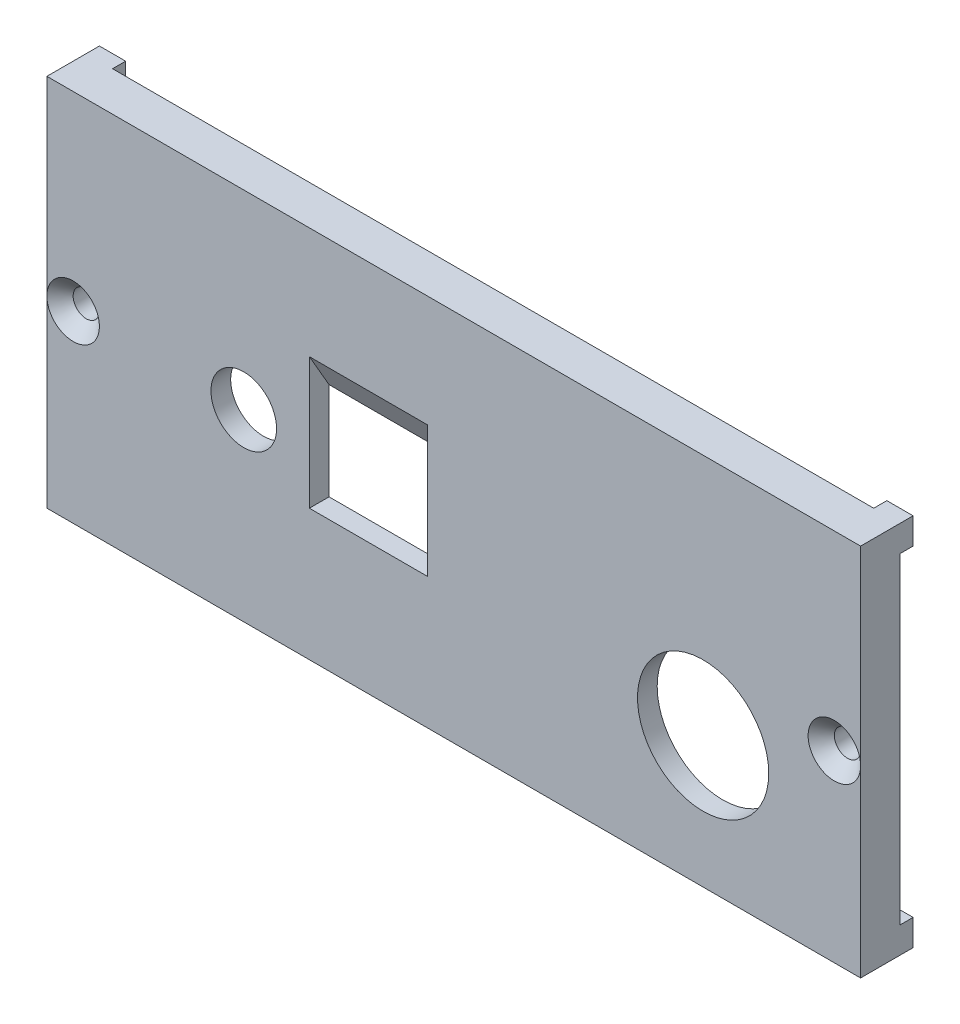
ISO-10303-21;
HEADER;
FILE_DESCRIPTION(('STEP AP214'),'2;1');
FILE_NAME('part.step','',(''),(''),'','','');
FILE_SCHEMA(('AUTOMOTIVE_DESIGN { 1 0 10303 214 1 1 1 1 }'));
ENDSEC;
DATA;
#1=APPLICATION_CONTEXT('core data for automotive mechanical design processes');
#2=APPLICATION_PROTOCOL_DEFINITION('international standard','automotive_design',2000,#1);
#3=PRODUCT_CONTEXT('',#1,'mechanical');
#4=PRODUCT('Part','Part','',(#3));
#5=PRODUCT_RELATED_PRODUCT_CATEGORY('part','',(#4));
#6=PRODUCT_DEFINITION_FORMATION('','',#4);
#7=PRODUCT_DEFINITION_CONTEXT('part definition',#1,'design');
#8=PRODUCT_DEFINITION('design','',#6,#7);
#9=PRODUCT_DEFINITION_SHAPE('','',#8);
#10=(LENGTH_UNIT() NAMED_UNIT(*) SI_UNIT(.MILLI.,.METRE.));
#11=(NAMED_UNIT(*) PLANE_ANGLE_UNIT() SI_UNIT($,.RADIAN.));
#12=(NAMED_UNIT(*) SI_UNIT($,.STERADIAN.) SOLID_ANGLE_UNIT());
#13=UNCERTAINTY_MEASURE_WITH_UNIT(LENGTH_MEASURE(1.E-05),#10,'distance_accuracy_value','');
#14=(GEOMETRIC_REPRESENTATION_CONTEXT(3) GLOBAL_UNCERTAINTY_ASSIGNED_CONTEXT((#13)) GLOBAL_UNIT_ASSIGNED_CONTEXT((#10,
#11,#12)) REPRESENTATION_CONTEXT('',''));
#15=CARTESIAN_POINT('',(0.,0.,0.));
#16=DIRECTION('',(0.,0.,1.));
#17=DIRECTION('',(1.,0.,0.));
#18=AXIS2_PLACEMENT_3D('',#15,#16,#17);
#19=CARTESIAN_POINT('',(31.,28.5,0.));
#20=DIRECTION('',(0.,0.,1.));
#21=DIRECTION('',(1.,0.,0.));
#22=AXIS2_PLACEMENT_3D('',#19,#20,#21);
#23=PLANE('',#22);
#24=CARTESIAN_POINT('',(-29.,14.,0.));
#25=DIRECTION('',(0.,0.,-1.));
#26=DIRECTION('',(-1.,0.,0.));
#27=AXIS2_PLACEMENT_3D('',#24,#25,#26);
#28=CIRCLE('',#27,1.);
#29=CARTESIAN_POINT('',(-30.,14.,0.));
#30=VERTEX_POINT('',#29);
#31=EDGE_CURVE('E231',#30,#30,#28,.T.);
#32=ORIENTED_EDGE('',*,*,#31,.F.);
#33=EDGE_LOOP('',(#32));
#34=FACE_BOUND('',#33,.T.);
#35=CARTESIAN_POINT('',(29.,14.,0.));
#36=DIRECTION('',(0.,0.,-1.));
#37=DIRECTION('',(-1.,0.,0.));
#38=AXIS2_PLACEMENT_3D('',#35,#36,#37);
#39=CIRCLE('',#38,1.);
#40=CARTESIAN_POINT('',(28.,14.,0.));
#41=VERTEX_POINT('',#40);
#42=EDGE_CURVE('E234',#41,#41,#39,.T.);
#43=ORIENTED_EDGE('',*,*,#42,.F.);
#44=EDGE_LOOP('',(#43));
#45=FACE_BOUND('',#44,.T.);
#46=DIRECTION('',(0.,1.,0.));
#47=VECTOR('',#46,1.);
#48=CARTESIAN_POINT('',(-27.,14.25,0.));
#49=LINE('',#48,#47);
#50=CARTESIAN_POINT('',(-27.,2.,0.));
#51=VERTEX_POINT('',#50);
#52=CARTESIAN_POINT('',(-27.,25.5,0.));
#53=VERTEX_POINT('',#52);
#54=EDGE_CURVE('E358',#51,#53,#49,.T.);
#55=ORIENTED_EDGE('',*,*,#54,.F.);
#56=DIRECTION('',(-1.,0.,0.));
#57=VECTOR('',#56,1.);
#58=CARTESIAN_POINT('',(-53.217133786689,2.,0.));
#59=LINE('',#58,#57);
#60=CARTESIAN_POINT('',(27.,2.,0.));
#61=VERTEX_POINT('',#60);
#62=EDGE_CURVE('E355',#61,#51,#59,.T.);
#63=ORIENTED_EDGE('',*,*,#62,.F.);
#64=DIRECTION('',(0.,1.,0.));
#65=VECTOR('',#64,1.);
#66=CARTESIAN_POINT('',(27.,14.25,0.));
#67=LINE('',#66,#65);
#68=CARTESIAN_POINT('',(27.,25.5,0.));
#69=VERTEX_POINT('',#68);
#70=EDGE_CURVE('E808',#61,#69,#67,.T.);
#71=ORIENTED_EDGE('',*,*,#70,.T.);
#72=DIRECTION('',(1.,0.,0.));
#73=VECTOR('',#72,1.);
#74=CARTESIAN_POINT('',(-53.217133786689,25.5,0.));
#75=LINE('',#74,#73);
#76=EDGE_CURVE('E812',#53,#69,#75,.T.);
#77=ORIENTED_EDGE('',*,*,#76,.F.);
#78=EDGE_LOOP('',(#55,#63,#71,#77));
#79=FACE_BOUND('',#78,.T.);
#80=DIRECTION('',(1.,0.,0.));
#81=VECTOR('',#80,1.);
#82=CARTESIAN_POINT('',(-31.,2.,0.));
#83=LINE('',#82,#81);
#84=CARTESIAN_POINT('',(-31.,2.,0.));
#85=VERTEX_POINT('',#84);
#86=CARTESIAN_POINT('',(-29.,2.,0.));
#87=VERTEX_POINT('',#86);
#88=EDGE_CURVE('E237',#85,#87,#83,.T.);
#89=ORIENTED_EDGE('',*,*,#88,.F.);
#90=DIRECTION('',(0.,-1.,0.));
#91=VECTOR('',#90,1.);
#92=CARTESIAN_POINT('',(-31.,0.,0.));
#93=LINE('',#92,#91);
#94=CARTESIAN_POINT('',(-31.,26.5,0.));
#95=VERTEX_POINT('',#94);
#96=EDGE_CURVE('E342',#95,#85,#93,.T.);
#97=ORIENTED_EDGE('',*,*,#96,.F.);
#98=DIRECTION('',(-1.,0.,0.));
#99=VECTOR('',#98,1.);
#100=CARTESIAN_POINT('',(-31.,26.5,0.));
#101=LINE('',#100,#99);
#102=CARTESIAN_POINT('',(-29.,26.5,0.));
#103=VERTEX_POINT('',#102);
#104=EDGE_CURVE('E264',#103,#95,#101,.T.);
#105=ORIENTED_EDGE('',*,*,#104,.F.);
#106=DIRECTION('',(0.,-1.,0.));
#107=VECTOR('',#106,1.);
#108=CARTESIAN_POINT('',(-29.,28.5,0.));
#109=LINE('',#108,#107);
#110=CARTESIAN_POINT('',(-29.,28.5,0.));
#111=VERTEX_POINT('',#110);
#112=EDGE_CURVE('E259',#111,#103,#109,.T.);
#113=ORIENTED_EDGE('',*,*,#112,.F.);
#114=DIRECTION('',(-1.,0.,0.));
#115=VECTOR('',#114,1.);
#116=CARTESIAN_POINT('',(31.,28.5,0.));
#117=LINE('',#116,#115);
#118=CARTESIAN_POINT('',(29.,28.5,0.));
#119=VERTEX_POINT('',#118);
#120=EDGE_CURVE('E332',#119,#111,#117,.T.);
#121=ORIENTED_EDGE('',*,*,#120,.F.);
#122=DIRECTION('',(0.,1.,0.));
#123=VECTOR('',#122,1.);
#124=CARTESIAN_POINT('',(29.,28.5,0.));
#125=LINE('',#124,#123);
#126=CARTESIAN_POINT('',(29.,26.5,0.));
#127=VERTEX_POINT('',#126);
#128=EDGE_CURVE('E307',#127,#119,#125,.T.);
#129=ORIENTED_EDGE('',*,*,#128,.F.);
#130=DIRECTION('',(-1.,0.,0.));
#131=VECTOR('',#130,1.);
#132=CARTESIAN_POINT('',(31.,26.5,0.));
#133=LINE('',#132,#131);
#134=CARTESIAN_POINT('',(31.,26.5,0.));
#135=VERTEX_POINT('',#134);
#136=EDGE_CURVE('E302',#135,#127,#133,.T.);
#137=ORIENTED_EDGE('',*,*,#136,.F.);
#138=DIRECTION('',(0.,1.,0.));
#139=VECTOR('',#138,1.);
#140=CARTESIAN_POINT('',(31.,0.,0.));
#141=LINE('',#140,#139);
#142=CARTESIAN_POINT('',(31.,2.,0.));
#143=VERTEX_POINT('',#142);
#144=EDGE_CURVE('E329',#143,#135,#141,.T.);
#145=ORIENTED_EDGE('',*,*,#144,.F.);
#146=DIRECTION('',(1.,0.,0.));
#147=VECTOR('',#146,1.);
#148=CARTESIAN_POINT('',(31.,2.,0.));
#149=LINE('',#148,#147);
#150=CARTESIAN_POINT('',(29.,2.,0.));
#151=VERTEX_POINT('',#150);
#152=EDGE_CURVE('E285',#151,#143,#149,.T.);
#153=ORIENTED_EDGE('',*,*,#152,.F.);
#154=DIRECTION('',(0.,1.,0.));
#155=VECTOR('',#154,1.);
#156=CARTESIAN_POINT('',(29.,0.,0.));
#157=LINE('',#156,#155);
#158=CARTESIAN_POINT('',(29.,0.,0.));
#159=VERTEX_POINT('',#158);
#160=EDGE_CURVE('E280',#159,#151,#157,.T.);
#161=ORIENTED_EDGE('',*,*,#160,.F.);
#162=DIRECTION('',(1.,0.,0.));
#163=VECTOR('',#162,1.);
#164=CARTESIAN_POINT('',(-31.,0.,0.));
#165=LINE('',#164,#163);
#166=CARTESIAN_POINT('',(-29.,0.,0.));
#167=VERTEX_POINT('',#166);
#168=EDGE_CURVE('E397',#167,#159,#165,.T.);
#169=ORIENTED_EDGE('',*,*,#168,.F.);
#170=DIRECTION('',(0.,-1.,0.));
#171=VECTOR('',#170,1.);
#172=CARTESIAN_POINT('',(-29.,0.,0.));
#173=LINE('',#172,#171);
#174=EDGE_CURVE('E242',#87,#167,#173,.T.);
#175=ORIENTED_EDGE('',*,*,#174,.F.);
#176=EDGE_LOOP('',(#89,#97,#105,#113,#121,#129,#137,#145,#153,#161,#169,#175));
#177=FACE_BOUND('',#176,.T.);
#178=ADVANCED_FACE('F31',(#34,#45,#79,#177),#23,.F.);
#179=CARTESIAN_POINT('',(31.,0.,3.));
#180=DIRECTION('',(-1.,0.,0.));
#181=DIRECTION('',(0.,0.,1.));
#182=AXIS2_PLACEMENT_3D('',#179,#180,#181);
#183=PLANE('',#182);
#184=DIRECTION('',(0.,0.,-1.));
#185=VECTOR('',#184,1.);
#186=CARTESIAN_POINT('',(31.,0.,3.));
#187=LINE('',#186,#185);
#188=CARTESIAN_POINT('',(31.,0.,3.));
#189=VERTEX_POINT('',#188);
#190=CARTESIAN_POINT('',(31.,0.,-1.));
#191=VERTEX_POINT('',#190);
#192=EDGE_CURVE('E413',#189,#191,#187,.T.);
#193=ORIENTED_EDGE('',*,*,#192,.T.);
#194=DIRECTION('',(0.,-1.,0.));
#195=VECTOR('',#194,1.);
#196=CARTESIAN_POINT('',(31.,0.,-1.));
#197=LINE('',#196,#195);
#198=CARTESIAN_POINT('',(31.,2.,-1.));
#199=VERTEX_POINT('',#198);
#200=EDGE_CURVE('E281',#199,#191,#197,.T.);
#201=ORIENTED_EDGE('',*,*,#200,.F.);
#202=DIRECTION('',(0.,0.,1.));
#203=VECTOR('',#202,1.);
#204=CARTESIAN_POINT('',(31.,2.,-1.));
#205=LINE('',#204,#203);
#206=EDGE_CURVE('E291',#199,#143,#205,.T.);
#207=ORIENTED_EDGE('',*,*,#206,.T.);
#208=ORIENTED_EDGE('',*,*,#144,.T.);
#209=DIRECTION('',(0.,0.,1.));
#210=VECTOR('',#209,1.);
#211=CARTESIAN_POINT('',(31.,26.5,-1.));
#212=LINE('',#211,#210);
#213=CARTESIAN_POINT('',(31.,26.5,-1.));
#214=VERTEX_POINT('',#213);
#215=EDGE_CURVE('E353',#214,#135,#212,.T.);
#216=ORIENTED_EDGE('',*,*,#215,.F.);
#217=DIRECTION('',(0.,-1.,0.));
#218=VECTOR('',#217,1.);
#219=CARTESIAN_POINT('',(31.,28.5,-1.));
#220=LINE('',#219,#218);
#221=CARTESIAN_POINT('',(31.,28.5,-1.));
#222=VERTEX_POINT('',#221);
#223=EDGE_CURVE('E303',#222,#214,#220,.T.);
#224=ORIENTED_EDGE('',*,*,#223,.F.);
#225=DIRECTION('',(0.,0.,-1.));
#226=VECTOR('',#225,1.);
#227=CARTESIAN_POINT('',(31.,28.5,3.));
#228=LINE('',#227,#226);
#229=CARTESIAN_POINT('',(31.,28.5,3.));
#230=VERTEX_POINT('',#229);
#231=EDGE_CURVE('E348',#230,#222,#228,.T.);
#232=ORIENTED_EDGE('',*,*,#231,.F.);
#233=DIRECTION('',(0.,1.,0.));
#234=VECTOR('',#233,1.);
#235=CARTESIAN_POINT('',(31.,0.,3.));
#236=LINE('',#235,#234);
#237=CARTESIAN_POINT('',(31.,14.,3.));
#238=VERTEX_POINT('',#237);
#239=EDGE_CURVE('E408',#238,#230,#236,.T.);
#240=ORIENTED_EDGE('',*,*,#239,.F.);
#241=EDGE_CURVE('E409',#189,#238,#236,.T.);
#242=ORIENTED_EDGE('',*,*,#241,.F.);
#243=EDGE_LOOP('',(#193,#201,#207,#208,#216,#224,#232,#240,#242));
#244=FACE_BOUND('',#243,.T.);
#245=ADVANCED_FACE('F386',(#244),#183,.F.);
#246=CARTESIAN_POINT('',(31.,28.5,3.));
#247=DIRECTION('',(0.,-1.,0.));
#248=DIRECTION('',(0.,0.,-1.));
#249=AXIS2_PLACEMENT_3D('',#246,#247,#248);
#250=PLANE('',#249);
#251=ORIENTED_EDGE('',*,*,#231,.T.);
#252=DIRECTION('',(1.,0.,0.));
#253=VECTOR('',#252,1.);
#254=CARTESIAN_POINT('',(31.,28.5,-1.));
#255=LINE('',#254,#253);
#256=CARTESIAN_POINT('',(29.,28.5,-1.));
#257=VERTEX_POINT('',#256);
#258=EDGE_CURVE('E311',#257,#222,#255,.T.);
#259=ORIENTED_EDGE('',*,*,#258,.F.);
#260=DIRECTION('',(0.,0.,1.));
#261=VECTOR('',#260,1.);
#262=CARTESIAN_POINT('',(29.,28.5,-1.));
#263=LINE('',#262,#261);
#264=EDGE_CURVE('E314',#257,#119,#263,.T.);
#265=ORIENTED_EDGE('',*,*,#264,.T.);
#266=ORIENTED_EDGE('',*,*,#120,.T.);
#267=DIRECTION('',(0.,0.,1.));
#268=VECTOR('',#267,1.);
#269=CARTESIAN_POINT('',(-29.,28.5,-1.));
#270=LINE('',#269,#268);
#271=CARTESIAN_POINT('',(-29.,28.5,-1.));
#272=VERTEX_POINT('',#271);
#273=EDGE_CURVE('E278',#272,#111,#270,.T.);
#274=ORIENTED_EDGE('',*,*,#273,.F.);
#275=DIRECTION('',(1.,0.,0.));
#276=VECTOR('',#275,1.);
#277=CARTESIAN_POINT('',(-31.,28.5,-1.));
#278=LINE('',#277,#276);
#279=CARTESIAN_POINT('',(-31.,28.5,-1.));
#280=VERTEX_POINT('',#279);
#281=EDGE_CURVE('E263',#280,#272,#278,.T.);
#282=ORIENTED_EDGE('',*,*,#281,.F.);
#283=DIRECTION('',(0.,0.,-1.));
#284=VECTOR('',#283,1.);
#285=CARTESIAN_POINT('',(-31.,28.5,3.));
#286=LINE('',#285,#284);
#287=CARTESIAN_POINT('',(-31.,28.5,3.));
#288=VERTEX_POINT('',#287);
#289=EDGE_CURVE('E416',#288,#280,#286,.T.);
#290=ORIENTED_EDGE('',*,*,#289,.F.);
#291=DIRECTION('',(-1.,0.,0.));
#292=VECTOR('',#291,1.);
#293=CARTESIAN_POINT('',(31.,28.5,3.));
#294=LINE('',#293,#292);
#295=EDGE_CURVE('E442',#230,#288,#294,.T.);
#296=ORIENTED_EDGE('',*,*,#295,.F.);
#297=EDGE_LOOP('',(#251,#259,#265,#266,#274,#282,#290,#296));
#298=FACE_BOUND('',#297,.T.);
#299=ADVANCED_FACE('F376',(#298),#250,.F.);
#300=CARTESIAN_POINT('',(-31.,0.,3.));
#301=DIRECTION('',(1.,0.,0.));
#302=DIRECTION('',(0.,0.,-1.));
#303=AXIS2_PLACEMENT_3D('',#300,#301,#302);
#304=PLANE('',#303);
#305=ORIENTED_EDGE('',*,*,#289,.T.);
#306=DIRECTION('',(0.,1.,0.));
#307=VECTOR('',#306,1.);
#308=CARTESIAN_POINT('',(-31.,28.5,-1.));
#309=LINE('',#308,#307);
#310=CARTESIAN_POINT('',(-31.,26.5,-1.));
#311=VERTEX_POINT('',#310);
#312=EDGE_CURVE('E260',#311,#280,#309,.T.);
#313=ORIENTED_EDGE('',*,*,#312,.F.);
#314=DIRECTION('',(0.,0.,1.));
#315=VECTOR('',#314,1.);
#316=CARTESIAN_POINT('',(-31.,26.5,-1.));
#317=LINE('',#316,#315);
#318=EDGE_CURVE('E270',#311,#95,#317,.T.);
#319=ORIENTED_EDGE('',*,*,#318,.T.);
#320=ORIENTED_EDGE('',*,*,#96,.T.);
#321=DIRECTION('',(0.,0.,1.));
#322=VECTOR('',#321,1.);
#323=CARTESIAN_POINT('',(-31.,2.,-1.));
#324=LINE('',#323,#322);
#325=CARTESIAN_POINT('',(-31.,2.,-1.));
#326=VERTEX_POINT('',#325);
#327=EDGE_CURVE('E257',#326,#85,#324,.T.);
#328=ORIENTED_EDGE('',*,*,#327,.F.);
#329=DIRECTION('',(0.,1.,0.));
#330=VECTOR('',#329,1.);
#331=CARTESIAN_POINT('',(-31.,0.,-1.));
#332=LINE('',#331,#330);
#333=CARTESIAN_POINT('',(-31.,0.,-1.));
#334=VERTEX_POINT('',#333);
#335=EDGE_CURVE('E238',#334,#326,#332,.T.);
#336=ORIENTED_EDGE('',*,*,#335,.F.);
#337=DIRECTION('',(0.,0.,-1.));
#338=VECTOR('',#337,1.);
#339=CARTESIAN_POINT('',(-31.,0.,3.));
#340=LINE('',#339,#338);
#341=CARTESIAN_POINT('',(-31.,0.,3.));
#342=VERTEX_POINT('',#341);
#343=EDGE_CURVE('E415',#342,#334,#340,.T.);
#344=ORIENTED_EDGE('',*,*,#343,.F.);
#345=DIRECTION('',(0.,-1.,0.));
#346=VECTOR('',#345,1.);
#347=CARTESIAN_POINT('',(-31.,0.,3.));
#348=LINE('',#347,#346);
#349=CARTESIAN_POINT('',(-31.,14.,3.));
#350=VERTEX_POINT('',#349);
#351=EDGE_CURVE('E443',#350,#342,#348,.T.);
#352=ORIENTED_EDGE('',*,*,#351,.F.);
#353=EDGE_CURVE('E448',#288,#350,#348,.T.);
#354=ORIENTED_EDGE('',*,*,#353,.F.);
#355=EDGE_LOOP('',(#305,#313,#319,#320,#328,#336,#344,#352,#354));
#356=FACE_BOUND('',#355,.T.);
#357=ADVANCED_FACE('F454',(#356),#304,.F.);
#358=CARTESIAN_POINT('',(-31.,0.,3.));
#359=DIRECTION('',(0.,1.,0.));
#360=DIRECTION('',(0.,0.,1.));
#361=AXIS2_PLACEMENT_3D('',#358,#359,#360);
#362=PLANE('',#361);
#363=ORIENTED_EDGE('',*,*,#343,.T.);
#364=DIRECTION('',(-1.,0.,0.));
#365=VECTOR('',#364,1.);
#366=CARTESIAN_POINT('',(-31.,0.,-1.));
#367=LINE('',#366,#365);
#368=CARTESIAN_POINT('',(-29.,0.,-1.));
#369=VERTEX_POINT('',#368);
#370=EDGE_CURVE('E246',#369,#334,#367,.T.);
#371=ORIENTED_EDGE('',*,*,#370,.F.);
#372=DIRECTION('',(0.,0.,1.));
#373=VECTOR('',#372,1.);
#374=CARTESIAN_POINT('',(-29.,0.,-1.));
#375=LINE('',#374,#373);
#376=EDGE_CURVE('E249',#369,#167,#375,.T.);
#377=ORIENTED_EDGE('',*,*,#376,.T.);
#378=ORIENTED_EDGE('',*,*,#168,.T.);
#379=DIRECTION('',(0.,0.,1.));
#380=VECTOR('',#379,1.);
#381=CARTESIAN_POINT('',(29.,0.,-1.));
#382=LINE('',#381,#380);
#383=CARTESIAN_POINT('',(29.,0.,-1.));
#384=VERTEX_POINT('',#383);
#385=EDGE_CURVE('E299',#384,#159,#382,.T.);
#386=ORIENTED_EDGE('',*,*,#385,.F.);
#387=DIRECTION('',(-1.,0.,0.));
#388=VECTOR('',#387,1.);
#389=CARTESIAN_POINT('',(31.,0.,-1.));
#390=LINE('',#389,#388);
#391=EDGE_CURVE('E284',#191,#384,#390,.T.);
#392=ORIENTED_EDGE('',*,*,#391,.F.);
#393=ORIENTED_EDGE('',*,*,#192,.F.);
#394=DIRECTION('',(1.,0.,0.));
#395=VECTOR('',#394,1.);
#396=CARTESIAN_POINT('',(-31.,0.,3.));
#397=LINE('',#396,#395);
#398=EDGE_CURVE('E338',#342,#189,#397,.T.);
#399=ORIENTED_EDGE('',*,*,#398,.F.);
#400=EDGE_LOOP('',(#363,#371,#377,#378,#386,#392,#393,#399));
#401=FACE_BOUND('',#400,.T.);
#402=ADVANCED_FACE('F404',(#401),#362,.F.);
#403=CARTESIAN_POINT('',(31.,28.5,3.));
#404=DIRECTION('',(0.,0.,1.));
#405=DIRECTION('',(1.,0.,0.));
#406=AXIS2_PLACEMENT_3D('',#403,#404,#405);
#407=PLANE('',#406);
#408=DIRECTION('',(0.,-1.,0.));
#409=VECTOR('',#408,1.);
#410=CARTESIAN_POINT('',(-11.,10.,3.));
#411=LINE('',#410,#409);
#412=CARTESIAN_POINT('',(-11.,20.,3.));
#413=VERTEX_POINT('',#412);
#414=CARTESIAN_POINT('',(-11.,10.,3.));
#415=VERTEX_POINT('',#414);
#416=EDGE_CURVE('E213',#413,#415,#411,.T.);
#417=ORIENTED_EDGE('',*,*,#416,.F.);
#418=DIRECTION('',(1.,0.,0.));
#419=VECTOR('',#418,1.);
#420=CARTESIAN_POINT('',(-2.,20.,3.));
#421=LINE('',#420,#419);
#422=CARTESIAN_POINT('',(-2.,20.,3.));
#423=VERTEX_POINT('',#422);
#424=EDGE_CURVE('E219',#413,#423,#421,.T.);
#425=ORIENTED_EDGE('',*,*,#424,.T.);
#426=DIRECTION('',(0.,1.,0.));
#427=VECTOR('',#426,1.);
#428=CARTESIAN_POINT('',(-2.,10.,3.));
#429=LINE('',#428,#427);
#430=CARTESIAN_POINT('',(-2.,10.,3.));
#431=VERTEX_POINT('',#430);
#432=EDGE_CURVE('E199',#431,#423,#429,.T.);
#433=ORIENTED_EDGE('',*,*,#432,.F.);
#434=DIRECTION('',(1.,0.,0.));
#435=VECTOR('',#434,1.);
#436=CARTESIAN_POINT('',(-11.,10.,3.));
#437=LINE('',#436,#435);
#438=EDGE_CURVE('E209',#415,#431,#437,.T.);
#439=ORIENTED_EDGE('',*,*,#438,.F.);
#440=EDGE_LOOP('',(#417,#425,#433,#439));
#441=FACE_BOUND('',#440,.T.);
#442=CARTESIAN_POINT('',(19.,10.,3.));
#443=DIRECTION('',(0.,0.,1.));
#444=DIRECTION('',(1.,0.,0.));
#445=AXIS2_PLACEMENT_3D('',#442,#443,#444);
#446=CIRCLE('',#445,5.);
#447=CARTESIAN_POINT('',(24.,10.,3.));
#448=VERTEX_POINT('',#447);
#449=EDGE_CURVE('E204',#448,#448,#446,.T.);
#450=ORIENTED_EDGE('',*,*,#449,.F.);
#451=EDGE_LOOP('',(#450));
#452=FACE_BOUND('',#451,.T.);
#453=CARTESIAN_POINT('',(-16.,14.,3.));
#454=DIRECTION('',(0.,0.,1.));
#455=DIRECTION('',(1.,0.,0.));
#456=AXIS2_PLACEMENT_3D('',#453,#454,#455);
#457=CIRCLE('',#456,2.5);
#458=CARTESIAN_POINT('',(-13.5,14.,3.));
#459=VERTEX_POINT('',#458);
#460=EDGE_CURVE('E227',#459,#459,#457,.T.);
#461=ORIENTED_EDGE('',*,*,#460,.F.);
#462=EDGE_LOOP('',(#461));
#463=FACE_BOUND('',#462,.T.);
#464=ORIENTED_EDGE('',*,*,#241,.T.);
#465=CARTESIAN_POINT('',(29.,14.,3.));
#466=DIRECTION('',(0.,0.,1.));
#467=DIRECTION('',(1.,0.,0.));
#468=AXIS2_PLACEMENT_3D('',#465,#466,#467);
#469=CIRCLE('',#468,1.99999999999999);
#470=EDGE_CURVE('E39',#238,#238,#469,.F.);
#471=ORIENTED_EDGE('',*,*,#470,.T.);
#472=ORIENTED_EDGE('',*,*,#239,.T.);
#473=ORIENTED_EDGE('',*,*,#295,.T.);
#474=ORIENTED_EDGE('',*,*,#353,.T.);
#475=CARTESIAN_POINT('',(-29.,14.,3.));
#476=DIRECTION('',(0.,0.,1.));
#477=DIRECTION('',(1.,0.,0.));
#478=AXIS2_PLACEMENT_3D('',#475,#476,#477);
#479=CIRCLE('',#478,1.99999999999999);
#480=EDGE_CURVE('E48',#350,#350,#479,.F.);
#481=ORIENTED_EDGE('',*,*,#480,.T.);
#482=ORIENTED_EDGE('',*,*,#351,.T.);
#483=ORIENTED_EDGE('',*,*,#398,.T.);
#484=EDGE_LOOP('',(#464,#471,#472,#473,#474,#481,#482,#483));
#485=FACE_BOUND('',#484,.T.);
#486=ADVANCED_FACE('F216',(#441,#452,#463,#485),#407,.T.);
#487=CARTESIAN_POINT('',(-53.217133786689,2.,1.5));
#488=DIRECTION('',(0.,-1.,0.));
#489=DIRECTION('',(0.,0.,-1.));
#490=AXIS2_PLACEMENT_3D('',#487,#488,#489);
#491=PLANE('',#490);
#492=ORIENTED_EDGE('',*,*,#62,.T.);
#493=DIRECTION('',(0.,0.,-1.));
#494=VECTOR('',#493,1.);
#495=CARTESIAN_POINT('',(-27.,2.,1.5));
#496=LINE('',#495,#494);
#497=CARTESIAN_POINT('',(-27.,2.,1.5));
#498=VERTEX_POINT('',#497);
#499=EDGE_CURVE('E446',#498,#51,#496,.T.);
#500=ORIENTED_EDGE('',*,*,#499,.F.);
#501=DIRECTION('',(-1.,0.,0.));
#502=VECTOR('',#501,1.);
#503=CARTESIAN_POINT('',(-53.217133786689,2.,1.5));
#504=LINE('',#503,#502);
#505=CARTESIAN_POINT('',(27.,2.,1.5));
#506=VERTEX_POINT('',#505);
#507=EDGE_CURVE('E803',#506,#498,#504,.T.);
#508=ORIENTED_EDGE('',*,*,#507,.F.);
#509=DIRECTION('',(0.,0.,-1.));
#510=VECTOR('',#509,1.);
#511=CARTESIAN_POINT('',(27.,2.,1.5));
#512=LINE('',#511,#510);
#513=EDGE_CURVE('E333',#506,#61,#512,.T.);
#514=ORIENTED_EDGE('',*,*,#513,.T.);
#515=EDGE_LOOP('',(#492,#500,#508,#514));
#516=FACE_BOUND('',#515,.T.);
#517=ADVANCED_FACE('F625',(#516),#491,.F.);
#518=CARTESIAN_POINT('',(27.,14.25,1.5));
#519=DIRECTION('',(-1.,0.,0.));
#520=DIRECTION('',(0.,0.,1.));
#521=AXIS2_PLACEMENT_3D('',#518,#519,#520);
#522=PLANE('',#521);
#523=ORIENTED_EDGE('',*,*,#70,.F.);
#524=ORIENTED_EDGE('',*,*,#513,.F.);
#525=DIRECTION('',(0.,1.,0.));
#526=VECTOR('',#525,1.);
#527=CARTESIAN_POINT('',(27.,14.25,1.5));
#528=LINE('',#527,#526);
#529=CARTESIAN_POINT('',(27.,25.5,1.5));
#530=VERTEX_POINT('',#529);
#531=EDGE_CURVE('E807',#506,#530,#528,.T.);
#532=ORIENTED_EDGE('',*,*,#531,.T.);
#533=DIRECTION('',(0.,0.,-1.));
#534=VECTOR('',#533,1.);
#535=CARTESIAN_POINT('',(27.,25.5,1.5));
#536=LINE('',#535,#534);
#537=EDGE_CURVE('E822',#530,#69,#536,.T.);
#538=ORIENTED_EDGE('',*,*,#537,.T.);
#539=EDGE_LOOP('',(#523,#524,#532,#538));
#540=FACE_BOUND('',#539,.T.);
#541=ADVANCED_FACE('F629',(#540),#522,.T.);
#542=CARTESIAN_POINT('',(-53.217133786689,25.5,1.5));
#543=DIRECTION('',(0.,1.,0.));
#544=DIRECTION('',(0.,0.,1.));
#545=AXIS2_PLACEMENT_3D('',#542,#543,#544);
#546=PLANE('',#545);
#547=ORIENTED_EDGE('',*,*,#76,.T.);
#548=ORIENTED_EDGE('',*,*,#537,.F.);
#549=DIRECTION('',(1.,0.,0.));
#550=VECTOR('',#549,1.);
#551=CARTESIAN_POINT('',(-53.217133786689,25.5,1.5));
#552=LINE('',#551,#550);
#553=CARTESIAN_POINT('',(-27.,25.5,1.5));
#554=VERTEX_POINT('',#553);
#555=EDGE_CURVE('E809',#554,#530,#552,.T.);
#556=ORIENTED_EDGE('',*,*,#555,.F.);
#557=DIRECTION('',(0.,0.,-1.));
#558=VECTOR('',#557,1.);
#559=CARTESIAN_POINT('',(-27.,25.5,1.5));
#560=LINE('',#559,#558);
#561=EDGE_CURVE('E823',#554,#53,#560,.T.);
#562=ORIENTED_EDGE('',*,*,#561,.T.);
#563=EDGE_LOOP('',(#547,#548,#556,#562));
#564=FACE_BOUND('',#563,.T.);
#565=ADVANCED_FACE('F636',(#564),#546,.F.);
#566=CARTESIAN_POINT('',(-27.,14.25,1.5));
#567=DIRECTION('',(-1.,0.,0.));
#568=DIRECTION('',(0.,0.,1.));
#569=AXIS2_PLACEMENT_3D('',#566,#567,#568);
#570=PLANE('',#569);
#571=ORIENTED_EDGE('',*,*,#54,.T.);
#572=ORIENTED_EDGE('',*,*,#561,.F.);
#573=DIRECTION('',(0.,1.,0.));
#574=VECTOR('',#573,1.);
#575=CARTESIAN_POINT('',(-27.,14.25,1.5));
#576=LINE('',#575,#574);
#577=EDGE_CURVE('E806',#498,#554,#576,.T.);
#578=ORIENTED_EDGE('',*,*,#577,.F.);
#579=ORIENTED_EDGE('',*,*,#499,.T.);
#580=EDGE_LOOP('',(#571,#572,#578,#579));
#581=FACE_BOUND('',#580,.T.);
#582=ADVANCED_FACE('F644',(#581),#570,.F.);
#583=CARTESIAN_POINT('',(-53.217133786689,14.25,1.5));
#584=DIRECTION('',(0.,0.,-1.));
#585=DIRECTION('',(-1.,0.,0.));
#586=AXIS2_PLACEMENT_3D('',#583,#584,#585);
#587=PLANE('',#586);
#588=DIRECTION('',(-1.,0.,0.));
#589=VECTOR('',#588,1.);
#590=CARTESIAN_POINT('',(-53.217133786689,17.4019237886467,1.5));
#591=LINE('',#590,#589);
#592=CARTESIAN_POINT('',(-2.,17.4019237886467,1.5));
#593=VERTEX_POINT('',#592);
#594=CARTESIAN_POINT('',(-11.,17.4019237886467,1.5));
#595=VERTEX_POINT('',#594);
#596=EDGE_CURVE('E427',#593,#595,#591,.T.);
#597=ORIENTED_EDGE('',*,*,#596,.T.);
#598=DIRECTION('',(0.,1.,0.));
#599=VECTOR('',#598,1.);
#600=CARTESIAN_POINT('',(-11.,14.25,1.5));
#601=LINE('',#600,#599);
#602=CARTESIAN_POINT('',(-11.,10.,1.5));
#603=VERTEX_POINT('',#602);
#604=EDGE_CURVE('E423',#603,#595,#601,.T.);
#605=ORIENTED_EDGE('',*,*,#604,.F.);
#606=DIRECTION('',(-1.,0.,0.));
#607=VECTOR('',#606,1.);
#608=CARTESIAN_POINT('',(-53.217133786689,10.,1.5));
#609=LINE('',#608,#607);
#610=CARTESIAN_POINT('',(-2.,10.,1.5));
#611=VERTEX_POINT('',#610);
#612=EDGE_CURVE('E421',#611,#603,#609,.T.);
#613=ORIENTED_EDGE('',*,*,#612,.F.);
#614=DIRECTION('',(0.,-1.,0.));
#615=VECTOR('',#614,1.);
#616=CARTESIAN_POINT('',(-2.,14.25,1.5));
#617=LINE('',#616,#615);
#618=EDGE_CURVE('E201',#593,#611,#617,.T.);
#619=ORIENTED_EDGE('',*,*,#618,.F.);
#620=EDGE_LOOP('',(#597,#605,#613,#619));
#621=FACE_BOUND('',#620,.T.);
#622=CARTESIAN_POINT('',(19.,10.,1.5));
#623=DIRECTION('',(0.,0.,-1.));
#624=DIRECTION('',(-1.,0.,0.));
#625=AXIS2_PLACEMENT_3D('',#622,#623,#624);
#626=CIRCLE('',#625,5.);
#627=CARTESIAN_POINT('',(14.,10.,1.5));
#628=VERTEX_POINT('',#627);
#629=EDGE_CURVE('E226',#628,#628,#626,.T.);
#630=ORIENTED_EDGE('',*,*,#629,.F.);
#631=EDGE_LOOP('',(#630));
#632=FACE_BOUND('',#631,.T.);
#633=CARTESIAN_POINT('',(-16.,14.,1.5));
#634=DIRECTION('',(0.,0.,-1.));
#635=DIRECTION('',(-1.,0.,0.));
#636=AXIS2_PLACEMENT_3D('',#633,#634,#635);
#637=CIRCLE('',#636,2.5);
#638=CARTESIAN_POINT('',(-18.5,14.,1.5));
#639=VERTEX_POINT('',#638);
#640=EDGE_CURVE('E230',#639,#639,#637,.T.);
#641=ORIENTED_EDGE('',*,*,#640,.F.);
#642=EDGE_LOOP('',(#641));
#643=FACE_BOUND('',#642,.T.);
#644=ORIENTED_EDGE('',*,*,#507,.T.);
#645=ORIENTED_EDGE('',*,*,#577,.T.);
#646=ORIENTED_EDGE('',*,*,#555,.T.);
#647=ORIENTED_EDGE('',*,*,#531,.F.);
#648=EDGE_LOOP('',(#644,#645,#646,#647));
#649=FACE_BOUND('',#648,.T.);
#650=ADVANCED_FACE('F652',(#621,#632,#643,#649),#587,.T.);
#651=CARTESIAN_POINT('',(31.,26.5,-1.));
#652=DIRECTION('',(0.,1.,0.));
#653=DIRECTION('',(0.,0.,1.));
#654=AXIS2_PLACEMENT_3D('',#651,#652,#653);
#655=PLANE('',#654);
#656=ORIENTED_EDGE('',*,*,#136,.T.);
#657=DIRECTION('',(0.,0.,1.));
#658=VECTOR('',#657,1.);
#659=CARTESIAN_POINT('',(29.,26.5,-1.));
#660=LINE('',#659,#658);
#661=CARTESIAN_POINT('',(29.,26.5,-1.));
#662=VERTEX_POINT('',#661);
#663=EDGE_CURVE('E317',#662,#127,#660,.T.);
#664=ORIENTED_EDGE('',*,*,#663,.F.);
#665=DIRECTION('',(-1.,0.,0.));
#666=VECTOR('',#665,1.);
#667=CARTESIAN_POINT('',(31.,26.5,-1.));
#668=LINE('',#667,#666);
#669=EDGE_CURVE('E306',#214,#662,#668,.T.);
#670=ORIENTED_EDGE('',*,*,#669,.F.);
#671=ORIENTED_EDGE('',*,*,#215,.T.);
#672=EDGE_LOOP('',(#656,#664,#670,#671));
#673=FACE_BOUND('',#672,.T.);
#674=ADVANCED_FACE('F366',(#673),#655,.F.);
#675=CARTESIAN_POINT('',(29.,28.5,-1.));
#676=DIRECTION('',(1.,0.,0.));
#677=DIRECTION('',(0.,0.,-1.));
#678=AXIS2_PLACEMENT_3D('',#675,#676,#677);
#679=PLANE('',#678);
#680=ORIENTED_EDGE('',*,*,#128,.T.);
#681=ORIENTED_EDGE('',*,*,#264,.F.);
#682=DIRECTION('',(0.,1.,0.));
#683=VECTOR('',#682,1.);
#684=CARTESIAN_POINT('',(29.,28.5,-1.));
#685=LINE('',#684,#683);
#686=EDGE_CURVE('E309',#662,#257,#685,.T.);
#687=ORIENTED_EDGE('',*,*,#686,.F.);
#688=ORIENTED_EDGE('',*,*,#663,.T.);
#689=EDGE_LOOP('',(#680,#681,#687,#688));
#690=FACE_BOUND('',#689,.T.);
#691=ADVANCED_FACE('F364',(#690),#679,.F.);
#692=CARTESIAN_POINT('',(31.,26.5,-1.));
#693=DIRECTION('',(0.,0.,-1.));
#694=DIRECTION('',(-1.,0.,0.));
#695=AXIS2_PLACEMENT_3D('',#692,#693,#694);
#696=PLANE('',#695);
#697=ORIENTED_EDGE('',*,*,#223,.T.);
#698=ORIENTED_EDGE('',*,*,#669,.T.);
#699=ORIENTED_EDGE('',*,*,#686,.T.);
#700=ORIENTED_EDGE('',*,*,#258,.T.);
#701=EDGE_LOOP('',(#697,#698,#699,#700));
#702=FACE_BOUND('',#701,.T.);
#703=ADVANCED_FACE('F384',(#702),#696,.T.);
#704=CARTESIAN_POINT('',(29.,0.,-1.));
#705=DIRECTION('',(1.,0.,0.));
#706=DIRECTION('',(0.,0.,-1.));
#707=AXIS2_PLACEMENT_3D('',#704,#705,#706);
#708=PLANE('',#707);
#709=ORIENTED_EDGE('',*,*,#160,.T.);
#710=DIRECTION('',(0.,0.,1.));
#711=VECTOR('',#710,1.);
#712=CARTESIAN_POINT('',(29.,2.,-1.));
#713=LINE('',#712,#711);
#714=CARTESIAN_POINT('',(29.,2.,-1.));
#715=VERTEX_POINT('',#714);
#716=EDGE_CURVE('E296',#715,#151,#713,.T.);
#717=ORIENTED_EDGE('',*,*,#716,.F.);
#718=DIRECTION('',(0.,1.,0.));
#719=VECTOR('',#718,1.);
#720=CARTESIAN_POINT('',(29.,0.,-1.));
#721=LINE('',#720,#719);
#722=EDGE_CURVE('E287',#384,#715,#721,.T.);
#723=ORIENTED_EDGE('',*,*,#722,.F.);
#724=ORIENTED_EDGE('',*,*,#385,.T.);
#725=EDGE_LOOP('',(#709,#717,#723,#724));
#726=FACE_BOUND('',#725,.T.);
#727=ADVANCED_FACE('F399',(#726),#708,.F.);
#728=CARTESIAN_POINT('',(31.,2.,-1.));
#729=DIRECTION('',(0.,-1.,0.));
#730=DIRECTION('',(0.,0.,-1.));
#731=AXIS2_PLACEMENT_3D('',#728,#729,#730);
#732=PLANE('',#731);
#733=ORIENTED_EDGE('',*,*,#152,.T.);
#734=ORIENTED_EDGE('',*,*,#206,.F.);
#735=DIRECTION('',(1.,0.,0.));
#736=VECTOR('',#735,1.);
#737=CARTESIAN_POINT('',(31.,2.,-1.));
#738=LINE('',#737,#736);
#739=EDGE_CURVE('E289',#715,#199,#738,.T.);
#740=ORIENTED_EDGE('',*,*,#739,.F.);
#741=ORIENTED_EDGE('',*,*,#716,.T.);
#742=EDGE_LOOP('',(#733,#734,#740,#741));
#743=FACE_BOUND('',#742,.T.);
#744=ADVANCED_FACE('F392',(#743),#732,.F.);
#745=CARTESIAN_POINT('',(31.,2.,-1.));
#746=DIRECTION('',(0.,0.,1.));
#747=DIRECTION('',(1.,0.,0.));
#748=AXIS2_PLACEMENT_3D('',#745,#746,#747);
#749=PLANE('',#748);
#750=ORIENTED_EDGE('',*,*,#200,.T.);
#751=ORIENTED_EDGE('',*,*,#391,.T.);
#752=ORIENTED_EDGE('',*,*,#722,.T.);
#753=ORIENTED_EDGE('',*,*,#739,.T.);
#754=EDGE_LOOP('',(#750,#751,#752,#753));
#755=FACE_BOUND('',#754,.T.);
#756=ADVANCED_FACE('F689',(#755),#749,.F.);
#757=CARTESIAN_POINT('',(-29.,28.5,-1.));
#758=DIRECTION('',(-1.,0.,0.));
#759=DIRECTION('',(0.,0.,1.));
#760=AXIS2_PLACEMENT_3D('',#757,#758,#759);
#761=PLANE('',#760);
#762=ORIENTED_EDGE('',*,*,#112,.T.);
#763=DIRECTION('',(0.,0.,1.));
#764=VECTOR('',#763,1.);
#765=CARTESIAN_POINT('',(-29.,26.5,-1.));
#766=LINE('',#765,#764);
#767=CARTESIAN_POINT('',(-29.,26.5,-1.));
#768=VERTEX_POINT('',#767);
#769=EDGE_CURVE('E275',#768,#103,#766,.T.);
#770=ORIENTED_EDGE('',*,*,#769,.F.);
#771=DIRECTION('',(0.,-1.,0.));
#772=VECTOR('',#771,1.);
#773=CARTESIAN_POINT('',(-29.,28.5,-1.));
#774=LINE('',#773,#772);
#775=EDGE_CURVE('E266',#272,#768,#774,.T.);
#776=ORIENTED_EDGE('',*,*,#775,.F.);
#777=ORIENTED_EDGE('',*,*,#273,.T.);
#778=EDGE_LOOP('',(#762,#770,#776,#777));
#779=FACE_BOUND('',#778,.T.);
#780=ADVANCED_FACE('F470',(#779),#761,.F.);
#781=CARTESIAN_POINT('',(-31.,26.5,-1.));
#782=DIRECTION('',(0.,1.,0.));
#783=DIRECTION('',(0.,0.,1.));
#784=AXIS2_PLACEMENT_3D('',#781,#782,#783);
#785=PLANE('',#784);
#786=ORIENTED_EDGE('',*,*,#104,.T.);
#787=ORIENTED_EDGE('',*,*,#318,.F.);
#788=DIRECTION('',(-1.,0.,0.));
#789=VECTOR('',#788,1.);
#790=CARTESIAN_POINT('',(-31.,26.5,-1.));
#791=LINE('',#790,#789);
#792=EDGE_CURVE('E268',#768,#311,#791,.T.);
#793=ORIENTED_EDGE('',*,*,#792,.F.);
#794=ORIENTED_EDGE('',*,*,#769,.T.);
#795=EDGE_LOOP('',(#786,#787,#793,#794));
#796=FACE_BOUND('',#795,.T.);
#797=ADVANCED_FACE('F467',(#796),#785,.F.);
#798=CARTESIAN_POINT('',(-31.,26.5,-1.));
#799=DIRECTION('',(0.,0.,1.));
#800=DIRECTION('',(1.,0.,0.));
#801=AXIS2_PLACEMENT_3D('',#798,#799,#800);
#802=PLANE('',#801);
#803=ORIENTED_EDGE('',*,*,#312,.T.);
#804=ORIENTED_EDGE('',*,*,#281,.T.);
#805=ORIENTED_EDGE('',*,*,#775,.T.);
#806=ORIENTED_EDGE('',*,*,#792,.T.);
#807=EDGE_LOOP('',(#803,#804,#805,#806));
#808=FACE_BOUND('',#807,.T.);
#809=ADVANCED_FACE('F472',(#808),#802,.F.);
#810=CARTESIAN_POINT('',(-31.,2.,-1.));
#811=DIRECTION('',(0.,-1.,0.));
#812=DIRECTION('',(0.,0.,-1.));
#813=AXIS2_PLACEMENT_3D('',#810,#811,#812);
#814=PLANE('',#813);
#815=ORIENTED_EDGE('',*,*,#88,.T.);
#816=DIRECTION('',(0.,0.,1.));
#817=VECTOR('',#816,1.);
#818=CARTESIAN_POINT('',(-29.,2.,-1.));
#819=LINE('',#818,#817);
#820=CARTESIAN_POINT('',(-29.,2.,-1.));
#821=VERTEX_POINT('',#820);
#822=EDGE_CURVE('E254',#821,#87,#819,.T.);
#823=ORIENTED_EDGE('',*,*,#822,.F.);
#824=DIRECTION('',(1.,0.,0.));
#825=VECTOR('',#824,1.);
#826=CARTESIAN_POINT('',(-31.,2.,-1.));
#827=LINE('',#826,#825);
#828=EDGE_CURVE('E241',#326,#821,#827,.T.);
#829=ORIENTED_EDGE('',*,*,#828,.F.);
#830=ORIENTED_EDGE('',*,*,#327,.T.);
#831=EDGE_LOOP('',(#815,#823,#829,#830));
#832=FACE_BOUND('',#831,.T.);
#833=ADVANCED_FACE('F474',(#832),#814,.F.);
#834=CARTESIAN_POINT('',(-29.,0.,-1.));
#835=DIRECTION('',(-1.,0.,0.));
#836=DIRECTION('',(0.,0.,1.));
#837=AXIS2_PLACEMENT_3D('',#834,#835,#836);
#838=PLANE('',#837);
#839=ORIENTED_EDGE('',*,*,#174,.T.);
#840=ORIENTED_EDGE('',*,*,#376,.F.);
#841=DIRECTION('',(0.,-1.,0.));
#842=VECTOR('',#841,1.);
#843=CARTESIAN_POINT('',(-29.,0.,-1.));
#844=LINE('',#843,#842);
#845=EDGE_CURVE('E244',#821,#369,#844,.T.);
#846=ORIENTED_EDGE('',*,*,#845,.F.);
#847=ORIENTED_EDGE('',*,*,#822,.T.);
#848=EDGE_LOOP('',(#839,#840,#846,#847));
#849=FACE_BOUND('',#848,.T.);
#850=ADVANCED_FACE('F461',(#849),#838,.F.);
#851=CARTESIAN_POINT('',(-31.,2.,-1.));
#852=DIRECTION('',(0.,0.,-1.));
#853=DIRECTION('',(-1.,0.,0.));
#854=AXIS2_PLACEMENT_3D('',#851,#852,#853);
#855=PLANE('',#854);
#856=ORIENTED_EDGE('',*,*,#335,.T.);
#857=ORIENTED_EDGE('',*,*,#828,.T.);
#858=ORIENTED_EDGE('',*,*,#845,.T.);
#859=ORIENTED_EDGE('',*,*,#370,.T.);
#860=EDGE_LOOP('',(#856,#857,#858,#859));
#861=FACE_BOUND('',#860,.T.);
#862=ADVANCED_FACE('F457',(#861),#855,.T.);
#863=CARTESIAN_POINT('',(29.,14.,3.));
#864=DIRECTION('',(0.,0.,-1.));
#865=DIRECTION('',(-1.,0.,0.));
#866=AXIS2_PLACEMENT_3D('',#863,#864,#865);
#867=CYLINDRICAL_SURFACE('',#866,1.);
#868=CARTESIAN_POINT('',(29.,14.,2.));
#869=DIRECTION('',(0.,0.,1.));
#870=DIRECTION('',(1.,0.,0.));
#871=AXIS2_PLACEMENT_3D('',#868,#869,#870);
#872=CIRCLE('',#871,1.);
#873=CARTESIAN_POINT('',(30.,14.,2.));
#874=VERTEX_POINT('',#873);
#875=EDGE_CURVE('E11',#874,#874,#872,.T.);
#876=ORIENTED_EDGE('',*,*,#875,.T.);
#877=EDGE_LOOP('',(#876));
#878=FACE_BOUND('',#877,.T.);
#879=ORIENTED_EDGE('',*,*,#42,.T.);
#880=EDGE_LOOP('',(#879));
#881=FACE_BOUND('',#880,.T.);
#882=ADVANCED_FACE('F516',(#878,#881),#867,.F.);
#883=CARTESIAN_POINT('',(-29.,14.,3.));
#884=DIRECTION('',(0.,0.,-1.));
#885=DIRECTION('',(-1.,0.,0.));
#886=AXIS2_PLACEMENT_3D('',#883,#884,#885);
#887=CYLINDRICAL_SURFACE('',#886,1.);
#888=CARTESIAN_POINT('',(-29.,14.,2.));
#889=DIRECTION('',(0.,0.,1.));
#890=DIRECTION('',(1.,0.,0.));
#891=AXIS2_PLACEMENT_3D('',#888,#889,#890);
#892=CIRCLE('',#891,1.);
#893=CARTESIAN_POINT('',(-28.,14.,2.));
#894=VERTEX_POINT('',#893);
#895=EDGE_CURVE('E437',#894,#894,#892,.T.);
#896=ORIENTED_EDGE('',*,*,#895,.T.);
#897=EDGE_LOOP('',(#896));
#898=FACE_BOUND('',#897,.T.);
#899=ORIENTED_EDGE('',*,*,#31,.T.);
#900=EDGE_LOOP('',(#899));
#901=FACE_BOUND('',#900,.T.);
#902=ADVANCED_FACE('F512',(#898,#901),#887,.F.);
#903=CARTESIAN_POINT('',(-16.,14.,-1.000025));
#904=DIRECTION('',(0.,0.,1.));
#905=DIRECTION('',(1.,0.,0.));
#906=AXIS2_PLACEMENT_3D('',#903,#904,#905);
#907=CYLINDRICAL_SURFACE('',#906,2.5);
#908=ORIENTED_EDGE('',*,*,#640,.T.);
#909=EDGE_LOOP('',(#908));
#910=FACE_BOUND('',#909,.T.);
#911=ORIENTED_EDGE('',*,*,#460,.T.);
#912=EDGE_LOOP('',(#911));
#913=FACE_BOUND('',#912,.T.);
#914=ADVANCED_FACE('F515',(#910,#913),#907,.F.);
#915=CARTESIAN_POINT('',(19.,10.,-1.000025));
#916=DIRECTION('',(0.,0.,1.));
#917=DIRECTION('',(1.,0.,0.));
#918=AXIS2_PLACEMENT_3D('',#915,#916,#917);
#919=CYLINDRICAL_SURFACE('',#918,5.);
#920=ORIENTED_EDGE('',*,*,#629,.T.);
#921=EDGE_LOOP('',(#920));
#922=FACE_BOUND('',#921,.T.);
#923=ORIENTED_EDGE('',*,*,#449,.T.);
#924=EDGE_LOOP('',(#923));
#925=FACE_BOUND('',#924,.T.);
#926=ADVANCED_FACE('F522',(#922,#925),#919,.F.);
#927=CARTESIAN_POINT('',(-11.,10.,-1.000025));
#928=DIRECTION('',(-1.,0.,0.));
#929=DIRECTION('',(0.,0.,1.));
#930=AXIS2_PLACEMENT_3D('',#927,#928,#929);
#931=PLANE('',#930);
#932=ORIENTED_EDGE('',*,*,#604,.T.);
#933=DIRECTION('',(0.,0.866025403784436,0.500000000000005));
#934=VECTOR('',#933,1.);
#935=CARTESIAN_POINT('',(-11.,10.7679383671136,-2.33013326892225));
#936=LINE('',#935,#934);
#937=EDGE_CURVE('E431',#595,#413,#936,.T.);
#938=ORIENTED_EDGE('',*,*,#937,.T.);
#939=ORIENTED_EDGE('',*,*,#416,.T.);
#940=DIRECTION('',(0.,0.,1.));
#941=VECTOR('',#940,1.);
#942=CARTESIAN_POINT('',(-11.,10.,-1.000025));
#943=LINE('',#942,#941);
#944=EDGE_CURVE('E205',#603,#415,#943,.T.);
#945=ORIENTED_EDGE('',*,*,#944,.F.);
#946=EDGE_LOOP('',(#932,#938,#939,#945));
#947=FACE_BOUND('',#946,.T.);
#948=ADVANCED_FACE('F585',(#947),#931,.F.);
#949=CARTESIAN_POINT('',(-2.,10.,-1.000025));
#950=DIRECTION('',(1.,0.,0.));
#951=DIRECTION('',(0.,0.,-1.));
#952=AXIS2_PLACEMENT_3D('',#949,#950,#951);
#953=PLANE('',#952);
#954=ORIENTED_EDGE('',*,*,#618,.T.);
#955=DIRECTION('',(0.,0.,1.));
#956=VECTOR('',#955,1.);
#957=CARTESIAN_POINT('',(-2.,10.,-1.000025));
#958=LINE('',#957,#956);
#959=EDGE_CURVE('E194',#611,#431,#958,.T.);
#960=ORIENTED_EDGE('',*,*,#959,.T.);
#961=ORIENTED_EDGE('',*,*,#432,.T.);
#962=DIRECTION('',(0.,-0.866025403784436,-0.500000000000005));
#963=VECTOR('',#962,1.);
#964=CARTESIAN_POINT('',(-2.,10.7679383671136,-2.33013326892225));
#965=LINE('',#964,#963);
#966=EDGE_CURVE('E434',#423,#593,#965,.T.);
#967=ORIENTED_EDGE('',*,*,#966,.T.);
#968=EDGE_LOOP('',(#954,#960,#961,#967));
#969=FACE_BOUND('',#968,.T.);
#970=ADVANCED_FACE('F196',(#969),#953,.F.);
#971=CARTESIAN_POINT('',(-11.,10.,-1.000025));
#972=DIRECTION('',(0.,-1.,0.));
#973=DIRECTION('',(0.,0.,-1.));
#974=AXIS2_PLACEMENT_3D('',#971,#972,#973);
#975=PLANE('',#974);
#976=ORIENTED_EDGE('',*,*,#612,.T.);
#977=ORIENTED_EDGE('',*,*,#944,.T.);
#978=ORIENTED_EDGE('',*,*,#438,.T.);
#979=ORIENTED_EDGE('',*,*,#959,.F.);
#980=EDGE_LOOP('',(#976,#977,#978,#979));
#981=FACE_BOUND('',#980,.T.);
#982=ADVANCED_FACE('F210',(#981),#975,.F.);
#983=CARTESIAN_POINT('',(-11.,16.,0.690598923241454));
#984=DIRECTION('',(0.,-0.500000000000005,0.866025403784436));
#985=DIRECTION('',(0.,-0.866025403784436,-0.500000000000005));
#986=AXIS2_PLACEMENT_3D('',#983,#984,#985);
#987=PLANE('',#986);
#988=ORIENTED_EDGE('',*,*,#966,.F.);
#989=ORIENTED_EDGE('',*,*,#424,.F.);
#990=ORIENTED_EDGE('',*,*,#937,.F.);
#991=ORIENTED_EDGE('',*,*,#596,.F.);
#992=EDGE_LOOP('',(#988,#989,#990,#991));
#993=FACE_BOUND('',#992,.T.);
#994=ADVANCED_FACE('F500',(#993),#987,.T.);
#995=CARTESIAN_POINT('',(-29.,14.,3.));
#996=DIRECTION('',(0.,0.,1.));
#997=DIRECTION('',(1.,0.,0.));
#998=AXIS2_PLACEMENT_3D('',#995,#996,#997);
#999=CONICAL_SURFACE('',#998,1.99999999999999,0.785398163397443);
#1000=ORIENTED_EDGE('',*,*,#895,.F.);
#1001=EDGE_LOOP('',(#1000));
#1002=FACE_BOUND('',#1001,.T.);
#1003=ORIENTED_EDGE('',*,*,#480,.F.);
#1004=EDGE_LOOP('',(#1003));
#1005=FACE_BOUND('',#1004,.T.);
#1006=ADVANCED_FACE('F502',(#1002,#1005),#999,.F.);
#1007=CARTESIAN_POINT('',(29.,14.,3.));
#1008=DIRECTION('',(0.,0.,1.));
#1009=DIRECTION('',(1.,0.,0.));
#1010=AXIS2_PLACEMENT_3D('',#1007,#1008,#1009);
#1011=CONICAL_SURFACE('',#1010,1.99999999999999,0.785398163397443);
#1012=ORIENTED_EDGE('',*,*,#875,.F.);
#1013=EDGE_LOOP('',(#1012));
#1014=FACE_BOUND('',#1013,.T.);
#1015=ORIENTED_EDGE('',*,*,#470,.F.);
#1016=EDGE_LOOP('',(#1015));
#1017=FACE_BOUND('',#1016,.T.);
#1018=ADVANCED_FACE('F33',(#1014,#1017),#1011,.F.);
#1019=CLOSED_SHELL('',(#178,#245,#299,#357,#402,#486,#517,#541,#565,#582,#650,#674,#691,#703,
#727,#744,#756,#780,#797,#809,#833,#850,#862,#882,#902,#914,#926,#948,#970,#982,#994,#1006,#1018));
#1020=MANIFOLD_SOLID_BREP('B2',#1019);
#1021=ADVANCED_BREP_SHAPE_REPRESENTATION('',(#18,#1020),#14);
#1022=SHAPE_DEFINITION_REPRESENTATION(#9,#1021);
ENDSEC;
END-ISO-10303-21;
